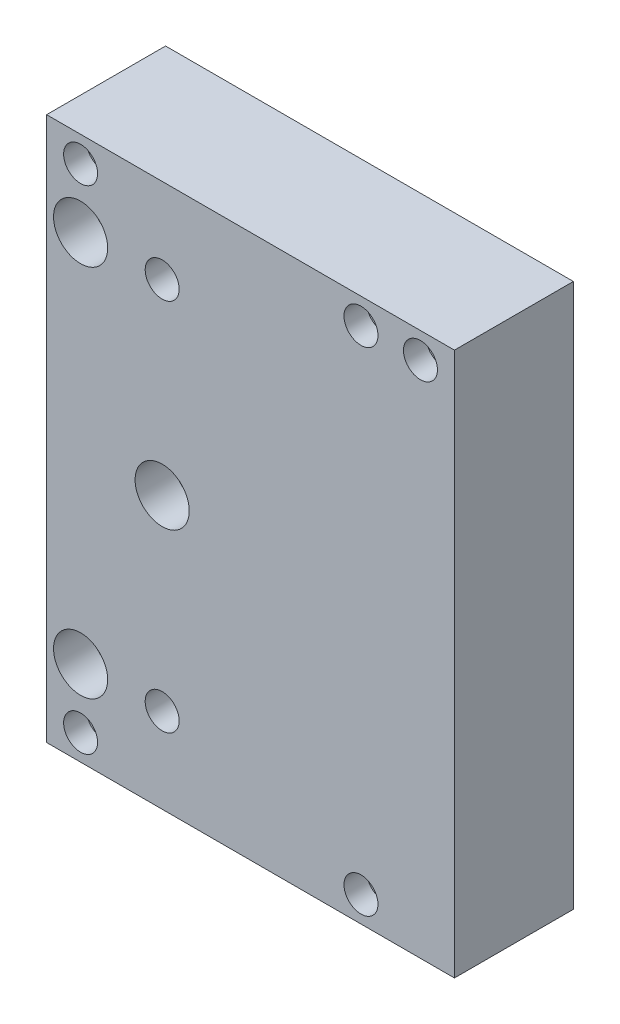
ISO-10303-21;
HEADER;
FILE_DESCRIPTION(('STEP AP214'),'2;1');
FILE_NAME('part.step','',(''),(''),'','','');
FILE_SCHEMA(('AUTOMOTIVE_DESIGN { 1 0 10303 214 1 1 1 1 }'));
ENDSEC;
DATA;
#1=APPLICATION_CONTEXT('core data for automotive mechanical design processes');
#2=APPLICATION_PROTOCOL_DEFINITION('international standard','automotive_design',2000,#1);
#3=PRODUCT_CONTEXT('',#1,'mechanical');
#4=PRODUCT('Part','Part','',(#3));
#5=PRODUCT_RELATED_PRODUCT_CATEGORY('part','',(#4));
#6=PRODUCT_DEFINITION_FORMATION('','',#4);
#7=PRODUCT_DEFINITION_CONTEXT('part definition',#1,'design');
#8=PRODUCT_DEFINITION('design','',#6,#7);
#9=PRODUCT_DEFINITION_SHAPE('','',#8);
#10=(LENGTH_UNIT() NAMED_UNIT(*) SI_UNIT(.MILLI.,.METRE.));
#11=(NAMED_UNIT(*) PLANE_ANGLE_UNIT() SI_UNIT($,.RADIAN.));
#12=(NAMED_UNIT(*) SI_UNIT($,.STERADIAN.) SOLID_ANGLE_UNIT());
#13=UNCERTAINTY_MEASURE_WITH_UNIT(LENGTH_MEASURE(1.E-05),#10,'distance_accuracy_value','');
#14=(GEOMETRIC_REPRESENTATION_CONTEXT(3) GLOBAL_UNCERTAINTY_ASSIGNED_CONTEXT((#13)) GLOBAL_UNIT_ASSIGNED_CONTEXT((#10,
#11,#12)) REPRESENTATION_CONTEXT('',''));
#15=CARTESIAN_POINT('',(0.,0.,0.));
#16=DIRECTION('',(0.,0.,1.));
#17=DIRECTION('',(1.,0.,0.));
#18=AXIS2_PLACEMENT_3D('',#15,#16,#17);
#19=CARTESIAN_POINT('',(-55.88,101.6,44.45));
#20=DIRECTION('',(1.,0.,0.));
#21=DIRECTION('',(0.,1.,0.));
#22=AXIS2_PLACEMENT_3D('',#19,#20,#21);
#23=PLANE('',#22);
#24=DIRECTION('',(0.,-1.,0.));
#25=VECTOR('',#24,1.);
#26=CARTESIAN_POINT('',(-55.88,101.6,0.));
#27=LINE('',#26,#25);
#28=CARTESIAN_POINT('',(-55.88,101.6,0.));
#29=VERTEX_POINT('',#28);
#30=CARTESIAN_POINT('',(-55.88,-101.6,0.));
#31=VERTEX_POINT('',#30);
#32=EDGE_CURVE('E123',#29,#31,#27,.T.);
#33=ORIENTED_EDGE('',*,*,#32,.T.);
#34=DIRECTION('',(0.,0.,-1.));
#35=VECTOR('',#34,1.);
#36=CARTESIAN_POINT('',(-55.88,-101.6,44.45));
#37=LINE('',#36,#35);
#38=CARTESIAN_POINT('',(-55.88,-101.6,44.45));
#39=VERTEX_POINT('',#38);
#40=EDGE_CURVE('E12',#39,#31,#37,.T.);
#41=ORIENTED_EDGE('',*,*,#40,.F.);
#42=DIRECTION('',(0.,-1.,0.));
#43=VECTOR('',#42,1.);
#44=CARTESIAN_POINT('',(-55.88,101.6,44.45));
#45=LINE('',#44,#43);
#46=CARTESIAN_POINT('',(-55.88,101.6,44.45));
#47=VERTEX_POINT('',#46);
#48=EDGE_CURVE('E106',#47,#39,#45,.T.);
#49=ORIENTED_EDGE('',*,*,#48,.F.);
#50=DIRECTION('',(0.,0.,-1.));
#51=VECTOR('',#50,1.);
#52=CARTESIAN_POINT('',(-55.88,101.6,44.45));
#53=LINE('',#52,#51);
#54=EDGE_CURVE('E119',#47,#29,#53,.T.);
#55=ORIENTED_EDGE('',*,*,#54,.T.);
#56=EDGE_LOOP('',(#33,#41,#49,#55));
#57=FACE_BOUND('',#56,.T.);
#58=ADVANCED_FACE('F54',(#57),#23,.F.);
#59=CARTESIAN_POINT('',(-55.88,-101.6,44.45));
#60=DIRECTION('',(0.,1.,0.));
#61=DIRECTION('',(-1.,0.,0.));
#62=AXIS2_PLACEMENT_3D('',#59,#60,#61);
#63=PLANE('',#62);
#64=DIRECTION('',(1.,0.,0.));
#65=VECTOR('',#64,1.);
#66=CARTESIAN_POINT('',(-55.88,-101.6,0.));
#67=LINE('',#66,#65);
#68=CARTESIAN_POINT('',(96.52,-101.6,0.));
#69=VERTEX_POINT('',#68);
#70=EDGE_CURVE('E111',#31,#69,#67,.T.);
#71=ORIENTED_EDGE('',*,*,#70,.T.);
#72=DIRECTION('',(0.,0.,-1.));
#73=VECTOR('',#72,1.);
#74=CARTESIAN_POINT('',(96.52,-101.6,44.45));
#75=LINE('',#74,#73);
#76=CARTESIAN_POINT('',(96.52,-101.6,44.45));
#77=VERTEX_POINT('',#76);
#78=EDGE_CURVE('E63',#77,#69,#75,.T.);
#79=ORIENTED_EDGE('',*,*,#78,.F.);
#80=DIRECTION('',(1.,0.,0.));
#81=VECTOR('',#80,1.);
#82=CARTESIAN_POINT('',(-55.88,-101.6,44.45));
#83=LINE('',#82,#81);
#84=EDGE_CURVE('E101',#39,#77,#83,.T.);
#85=ORIENTED_EDGE('',*,*,#84,.F.);
#86=ORIENTED_EDGE('',*,*,#40,.T.);
#87=EDGE_LOOP('',(#71,#79,#85,#86));
#88=FACE_BOUND('',#87,.T.);
#89=ADVANCED_FACE('F110',(#88),#63,.F.);
#90=CARTESIAN_POINT('',(96.52,101.6,44.45));
#91=DIRECTION('',(-1.,0.,0.));
#92=DIRECTION('',(0.,-1.,0.));
#93=AXIS2_PLACEMENT_3D('',#90,#91,#92);
#94=PLANE('',#93);
#95=DIRECTION('',(0.,1.,0.));
#96=VECTOR('',#95,1.);
#97=CARTESIAN_POINT('',(96.52,101.6,0.));
#98=LINE('',#97,#96);
#99=CARTESIAN_POINT('',(96.52,101.6,0.));
#100=VERTEX_POINT('',#99);
#101=EDGE_CURVE('E88',#69,#100,#98,.T.);
#102=ORIENTED_EDGE('',*,*,#101,.T.);
#103=DIRECTION('',(0.,0.,-1.));
#104=VECTOR('',#103,1.);
#105=CARTESIAN_POINT('',(96.52,101.6,44.45));
#106=LINE('',#105,#104);
#107=CARTESIAN_POINT('',(96.52,101.6,44.45));
#108=VERTEX_POINT('',#107);
#109=EDGE_CURVE('E113',#108,#100,#106,.T.);
#110=ORIENTED_EDGE('',*,*,#109,.F.);
#111=DIRECTION('',(0.,1.,0.));
#112=VECTOR('',#111,1.);
#113=CARTESIAN_POINT('',(96.52,101.6,44.45));
#114=LINE('',#113,#112);
#115=EDGE_CURVE('E104',#77,#108,#114,.T.);
#116=ORIENTED_EDGE('',*,*,#115,.F.);
#117=ORIENTED_EDGE('',*,*,#78,.T.);
#118=EDGE_LOOP('',(#102,#110,#116,#117));
#119=FACE_BOUND('',#118,.T.);
#120=ADVANCED_FACE('F114',(#119),#94,.F.);
#121=CARTESIAN_POINT('',(-55.88,101.6,44.45));
#122=DIRECTION('',(0.,-1.,0.));
#123=DIRECTION('',(1.,0.,0.));
#124=AXIS2_PLACEMENT_3D('',#121,#122,#123);
#125=PLANE('',#124);
#126=DIRECTION('',(-1.,0.,0.));
#127=VECTOR('',#126,1.);
#128=CARTESIAN_POINT('',(-55.88,101.6,0.));
#129=LINE('',#128,#127);
#130=EDGE_CURVE('E94',#100,#29,#129,.T.);
#131=ORIENTED_EDGE('',*,*,#130,.T.);
#132=ORIENTED_EDGE('',*,*,#54,.F.);
#133=DIRECTION('',(-1.,0.,0.));
#134=VECTOR('',#133,1.);
#135=CARTESIAN_POINT('',(-55.88,101.6,44.45));
#136=LINE('',#135,#134);
#137=EDGE_CURVE('E71',#108,#47,#136,.T.);
#138=ORIENTED_EDGE('',*,*,#137,.F.);
#139=ORIENTED_EDGE('',*,*,#109,.T.);
#140=EDGE_LOOP('',(#131,#132,#138,#139));
#141=FACE_BOUND('',#140,.T.);
#142=ADVANCED_FACE('F138',(#141),#125,.F.);
#143=CARTESIAN_POINT('',(0.,0.,44.45));
#144=DIRECTION('',(0.,0.,1.));
#145=DIRECTION('',(1.,0.,0.));
#146=AXIS2_PLACEMENT_3D('',#143,#144,#145);
#147=PLANE('',#146);
#148=CARTESIAN_POINT('',(-43.18,-69.85,44.45));
#149=DIRECTION('',(0.,0.,1.));
#150=DIRECTION('',(1.,0.,0.));
#151=AXIS2_PLACEMENT_3D('',#148,#149,#150);
#152=CIRCLE('',#151,10.1219);
#153=CARTESIAN_POINT('',(-33.0581,-69.85,44.45));
#154=VERTEX_POINT('',#153);
#155=EDGE_CURVE('E629',#154,#154,#152,.T.);
#156=ORIENTED_EDGE('',*,*,#155,.F.);
#157=EDGE_LOOP('',(#156));
#158=FACE_BOUND('',#157,.T.);
#159=CARTESIAN_POINT('',(-12.7,0.,44.45));
#160=DIRECTION('',(0.,0.,1.));
#161=DIRECTION('',(1.,0.,0.));
#162=AXIS2_PLACEMENT_3D('',#159,#160,#161);
#163=CIRCLE('',#162,10.1219);
#164=CARTESIAN_POINT('',(-2.5781,0.,44.45));
#165=VERTEX_POINT('',#164);
#166=EDGE_CURVE('E188',#165,#165,#163,.T.);
#167=ORIENTED_EDGE('',*,*,#166,.F.);
#168=EDGE_LOOP('',(#167));
#169=FACE_BOUND('',#168,.T.);
#170=CARTESIAN_POINT('',(-43.18,69.85,44.45));
#171=DIRECTION('',(0.,0.,1.));
#172=DIRECTION('',(1.,0.,0.));
#173=AXIS2_PLACEMENT_3D('',#170,#171,#172);
#174=CIRCLE('',#173,10.1219);
#175=CARTESIAN_POINT('',(-33.0581,69.85,44.45));
#176=VERTEX_POINT('',#175);
#177=EDGE_CURVE('E162',#176,#176,#174,.T.);
#178=ORIENTED_EDGE('',*,*,#177,.F.);
#179=EDGE_LOOP('',(#178));
#180=FACE_BOUND('',#179,.T.);
#181=CARTESIAN_POINT('',(-12.7,69.8499999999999,44.45));
#182=DIRECTION('',(0.,0.,-1.));
#183=DIRECTION('',(-1.,0.,0.));
#184=AXIS2_PLACEMENT_3D('',#181,#182,#183);
#185=CIRCLE('',#184,6.34999999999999);
#186=CARTESIAN_POINT('',(-19.05,69.8499999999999,44.45));
#187=VERTEX_POINT('',#186);
#188=EDGE_CURVE('E168',#187,#187,#185,.T.);
#189=ORIENTED_EDGE('',*,*,#188,.T.);
#190=EDGE_LOOP('',(#189));
#191=FACE_BOUND('',#190,.T.);
#192=CARTESIAN_POINT('',(-12.7,-69.8500000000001,44.45));
#193=DIRECTION('',(0.,0.,-1.));
#194=DIRECTION('',(-1.,0.,0.));
#195=AXIS2_PLACEMENT_3D('',#192,#193,#194);
#196=CIRCLE('',#195,6.34999999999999);
#197=CARTESIAN_POINT('',(-19.05,-69.8500000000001,44.45));
#198=VERTEX_POINT('',#197);
#199=EDGE_CURVE('E221',#198,#198,#196,.T.);
#200=ORIENTED_EDGE('',*,*,#199,.T.);
#201=EDGE_LOOP('',(#200));
#202=FACE_BOUND('',#201,.T.);
#203=CARTESIAN_POINT('',(83.82,92.0242,44.45));
#204=DIRECTION('',(0.,0.,1.));
#205=DIRECTION('',(1.,0.,0.));
#206=AXIS2_PLACEMENT_3D('',#203,#204,#205);
#207=CIRCLE('',#206,6.34999999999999);
#208=CARTESIAN_POINT('',(90.17,92.0242,44.45));
#209=VERTEX_POINT('',#208);
#210=EDGE_CURVE('E225',#209,#209,#207,.T.);
#211=ORIENTED_EDGE('',*,*,#210,.F.);
#212=EDGE_LOOP('',(#211));
#213=FACE_BOUND('',#212,.T.);
#214=CARTESIAN_POINT('',(-43.18,92.0242,44.45));
#215=DIRECTION('',(0.,0.,1.));
#216=DIRECTION('',(1.,0.,0.));
#217=AXIS2_PLACEMENT_3D('',#214,#215,#216);
#218=CIRCLE('',#217,6.35);
#219=CARTESIAN_POINT('',(-36.83,92.0242,44.45));
#220=VERTEX_POINT('',#219);
#221=EDGE_CURVE('E229',#220,#220,#218,.T.);
#222=ORIENTED_EDGE('',*,*,#221,.F.);
#223=EDGE_LOOP('',(#222));
#224=FACE_BOUND('',#223,.T.);
#225=CARTESIAN_POINT('',(61.595,92.0242,44.45));
#226=DIRECTION('',(0.,0.,1.));
#227=DIRECTION('',(1.,0.,0.));
#228=AXIS2_PLACEMENT_3D('',#225,#226,#227);
#229=CIRCLE('',#228,6.34999999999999);
#230=CARTESIAN_POINT('',(67.945,92.0242,44.45));
#231=VERTEX_POINT('',#230);
#232=EDGE_CURVE('E233',#231,#231,#229,.T.);
#233=ORIENTED_EDGE('',*,*,#232,.F.);
#234=EDGE_LOOP('',(#233));
#235=FACE_BOUND('',#234,.T.);
#236=CARTESIAN_POINT('',(61.595,-92.0242,44.45));
#237=DIRECTION('',(0.,0.,1.));
#238=DIRECTION('',(1.,0.,0.));
#239=AXIS2_PLACEMENT_3D('',#236,#237,#238);
#240=CIRCLE('',#239,6.34999999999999);
#241=CARTESIAN_POINT('',(67.945,-92.0242,44.45));
#242=VERTEX_POINT('',#241);
#243=EDGE_CURVE('E237',#242,#242,#240,.T.);
#244=ORIENTED_EDGE('',*,*,#243,.F.);
#245=EDGE_LOOP('',(#244));
#246=FACE_BOUND('',#245,.T.);
#247=CARTESIAN_POINT('',(-43.18,-92.0242,44.45));
#248=DIRECTION('',(0.,0.,1.));
#249=DIRECTION('',(1.,0.,0.));
#250=AXIS2_PLACEMENT_3D('',#247,#248,#249);
#251=CIRCLE('',#250,6.35);
#252=CARTESIAN_POINT('',(-36.83,-92.0242,44.45));
#253=VERTEX_POINT('',#252);
#254=EDGE_CURVE('E127',#253,#253,#251,.T.);
#255=ORIENTED_EDGE('',*,*,#254,.F.);
#256=EDGE_LOOP('',(#255));
#257=FACE_BOUND('',#256,.T.);
#258=ORIENTED_EDGE('',*,*,#48,.T.);
#259=ORIENTED_EDGE('',*,*,#84,.T.);
#260=ORIENTED_EDGE('',*,*,#115,.T.);
#261=ORIENTED_EDGE('',*,*,#137,.T.);
#262=EDGE_LOOP('',(#258,#259,#260,#261));
#263=FACE_BOUND('',#262,.T.);
#264=ADVANCED_FACE('F102',(#158,#169,#180,#191,#202,#213,#224,#235,#246,#257,#263),#147,.T.);
#265=CARTESIAN_POINT('',(0.,0.,0.));
#266=DIRECTION('',(0.,0.,1.));
#267=DIRECTION('',(1.,0.,0.));
#268=AXIS2_PLACEMENT_3D('',#265,#266,#267);
#269=PLANE('',#268);
#270=CARTESIAN_POINT('',(-43.18,-69.85,0.));
#271=DIRECTION('',(0.,0.,1.));
#272=DIRECTION('',(1.,0.,0.));
#273=AXIS2_PLACEMENT_3D('',#270,#271,#272);
#274=CIRCLE('',#273,6.74369999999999);
#275=CARTESIAN_POINT('',(-36.4363,-69.85,0.));
#276=VERTEX_POINT('',#275);
#277=EDGE_CURVE('E619',#276,#276,#274,.T.);
#278=ORIENTED_EDGE('',*,*,#277,.T.);
#279=EDGE_LOOP('',(#278));
#280=FACE_BOUND('',#279,.T.);
#281=CARTESIAN_POINT('',(-12.7,0.,0.));
#282=DIRECTION('',(0.,0.,1.));
#283=DIRECTION('',(1.,0.,0.));
#284=AXIS2_PLACEMENT_3D('',#281,#282,#283);
#285=CIRCLE('',#284,6.74369999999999);
#286=CARTESIAN_POINT('',(-5.95630000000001,0.,0.));
#287=VERTEX_POINT('',#286);
#288=EDGE_CURVE('E649',#287,#287,#285,.T.);
#289=ORIENTED_EDGE('',*,*,#288,.T.);
#290=EDGE_LOOP('',(#289));
#291=FACE_BOUND('',#290,.T.);
#292=CARTESIAN_POINT('',(-43.18,69.85,0.));
#293=DIRECTION('',(0.,0.,1.));
#294=DIRECTION('',(1.,0.,0.));
#295=AXIS2_PLACEMENT_3D('',#292,#293,#294);
#296=CIRCLE('',#295,6.74369999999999);
#297=CARTESIAN_POINT('',(-36.4363,69.85,0.));
#298=VERTEX_POINT('',#297);
#299=EDGE_CURVE('E182',#298,#298,#296,.T.);
#300=ORIENTED_EDGE('',*,*,#299,.T.);
#301=EDGE_LOOP('',(#300));
#302=FACE_BOUND('',#301,.T.);
#303=CARTESIAN_POINT('',(-12.7,69.8499999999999,0.));
#304=DIRECTION('',(0.,0.,-1.));
#305=DIRECTION('',(-1.,0.,0.));
#306=AXIS2_PLACEMENT_3D('',#303,#304,#305);
#307=CIRCLE('',#306,6.34999999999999);
#308=CARTESIAN_POINT('',(-19.05,69.8499999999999,0.));
#309=VERTEX_POINT('',#308);
#310=EDGE_CURVE('E684',#309,#309,#307,.T.);
#311=ORIENTED_EDGE('',*,*,#310,.F.);
#312=EDGE_LOOP('',(#311));
#313=FACE_BOUND('',#312,.T.);
#314=CARTESIAN_POINT('',(-12.7,-69.8500000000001,0.));
#315=DIRECTION('',(0.,0.,-1.));
#316=DIRECTION('',(-1.,0.,0.));
#317=AXIS2_PLACEMENT_3D('',#314,#315,#316);
#318=CIRCLE('',#317,6.34999999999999);
#319=CARTESIAN_POINT('',(-19.05,-69.8500000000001,0.));
#320=VERTEX_POINT('',#319);
#321=EDGE_CURVE('E688',#320,#320,#318,.T.);
#322=ORIENTED_EDGE('',*,*,#321,.F.);
#323=EDGE_LOOP('',(#322));
#324=FACE_BOUND('',#323,.T.);
#325=CARTESIAN_POINT('',(83.82,92.0242,0.));
#326=DIRECTION('',(0.,0.,1.));
#327=DIRECTION('',(1.,0.,0.));
#328=AXIS2_PLACEMENT_3D('',#325,#326,#327);
#329=CIRCLE('',#328,3.96874999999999);
#330=CARTESIAN_POINT('',(87.78875,92.0242,0.));
#331=VERTEX_POINT('',#330);
#332=EDGE_CURVE('E692',#331,#331,#329,.T.);
#333=ORIENTED_EDGE('',*,*,#332,.T.);
#334=EDGE_LOOP('',(#333));
#335=FACE_BOUND('',#334,.T.);
#336=CARTESIAN_POINT('',(-43.18,92.0242,0.));
#337=DIRECTION('',(0.,0.,1.));
#338=DIRECTION('',(1.,0.,0.));
#339=AXIS2_PLACEMENT_3D('',#336,#337,#338);
#340=CIRCLE('',#339,3.96875);
#341=CARTESIAN_POINT('',(-39.21125,92.0242,0.));
#342=VERTEX_POINT('',#341);
#343=EDGE_CURVE('E696',#342,#342,#340,.T.);
#344=ORIENTED_EDGE('',*,*,#343,.T.);
#345=EDGE_LOOP('',(#344));
#346=FACE_BOUND('',#345,.T.);
#347=CARTESIAN_POINT('',(61.595,92.0242,0.));
#348=DIRECTION('',(0.,0.,1.));
#349=DIRECTION('',(1.,0.,0.));
#350=AXIS2_PLACEMENT_3D('',#347,#348,#349);
#351=CIRCLE('',#350,3.96874999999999);
#352=CARTESIAN_POINT('',(65.56375,92.0242,0.));
#353=VERTEX_POINT('',#352);
#354=EDGE_CURVE('E700',#353,#353,#351,.T.);
#355=ORIENTED_EDGE('',*,*,#354,.T.);
#356=EDGE_LOOP('',(#355));
#357=FACE_BOUND('',#356,.T.);
#358=CARTESIAN_POINT('',(61.595,-92.0242,0.));
#359=DIRECTION('',(0.,0.,1.));
#360=DIRECTION('',(1.,0.,0.));
#361=AXIS2_PLACEMENT_3D('',#358,#359,#360);
#362=CIRCLE('',#361,3.96874999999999);
#363=CARTESIAN_POINT('',(65.56375,-92.0242,0.));
#364=VERTEX_POINT('',#363);
#365=EDGE_CURVE('E704',#364,#364,#362,.T.);
#366=ORIENTED_EDGE('',*,*,#365,.T.);
#367=EDGE_LOOP('',(#366));
#368=FACE_BOUND('',#367,.T.);
#369=CARTESIAN_POINT('',(-43.18,-92.0242,0.));
#370=DIRECTION('',(0.,0.,1.));
#371=DIRECTION('',(1.,0.,0.));
#372=AXIS2_PLACEMENT_3D('',#369,#370,#371);
#373=CIRCLE('',#372,3.96875);
#374=CARTESIAN_POINT('',(-39.21125,-92.0242,0.));
#375=VERTEX_POINT('',#374);
#376=EDGE_CURVE('E707',#375,#375,#373,.T.);
#377=ORIENTED_EDGE('',*,*,#376,.T.);
#378=EDGE_LOOP('',(#377));
#379=FACE_BOUND('',#378,.T.);
#380=ORIENTED_EDGE('',*,*,#32,.F.);
#381=ORIENTED_EDGE('',*,*,#130,.F.);
#382=ORIENTED_EDGE('',*,*,#101,.F.);
#383=ORIENTED_EDGE('',*,*,#70,.F.);
#384=EDGE_LOOP('',(#380,#381,#382,#383));
#385=FACE_BOUND('',#384,.T.);
#386=ADVANCED_FACE('F141',(#280,#291,#302,#313,#324,#335,#346,#357,#368,#379,#385),#269,.F.);
#387=CARTESIAN_POINT('',(-43.18,-92.0242,44.45));
#388=DIRECTION('',(0.,0.,1.));
#389=DIRECTION('',(1.,0.,0.));
#390=AXIS2_PLACEMENT_3D('',#387,#388,#389);
#391=CYLINDRICAL_SURFACE('',#390,6.35);
#392=CARTESIAN_POINT('',(-43.18,-92.0242,35.9664));
#393=DIRECTION('',(0.,0.,1.));
#394=DIRECTION('',(1.,0.,0.));
#395=AXIS2_PLACEMENT_3D('',#392,#393,#394);
#396=CIRCLE('',#395,6.35);
#397=CARTESIAN_POINT('',(-36.83,-92.0242,35.9664));
#398=VERTEX_POINT('',#397);
#399=EDGE_CURVE('E150',#398,#398,#396,.T.);
#400=ORIENTED_EDGE('',*,*,#399,.F.);
#401=EDGE_LOOP('',(#400));
#402=FACE_BOUND('',#401,.T.);
#403=ORIENTED_EDGE('',*,*,#254,.T.);
#404=EDGE_LOOP('',(#403));
#405=FACE_BOUND('',#404,.T.);
#406=ADVANCED_FACE('F240',(#402,#405),#391,.F.);
#407=CARTESIAN_POINT('',(-36.83,-92.0242,35.9664));
#408=DIRECTION('',(0.,0.,-1.));
#409=DIRECTION('',(-1.,0.,0.));
#410=AXIS2_PLACEMENT_3D('',#407,#408,#409);
#411=PLANE('',#410);
#412=CARTESIAN_POINT('',(-43.18,-92.0242,35.9664));
#413=DIRECTION('',(0.,0.,1.));
#414=DIRECTION('',(1.,0.,0.));
#415=AXIS2_PLACEMENT_3D('',#412,#413,#414);
#416=CIRCLE('',#415,3.96875);
#417=CARTESIAN_POINT('',(-39.21125,-92.0242,35.9664));
#418=VERTEX_POINT('',#417);
#419=EDGE_CURVE('E709',#418,#418,#416,.T.);
#420=ORIENTED_EDGE('',*,*,#419,.F.);
#421=EDGE_LOOP('',(#420));
#422=FACE_BOUND('',#421,.T.);
#423=ORIENTED_EDGE('',*,*,#399,.T.);
#424=EDGE_LOOP('',(#423));
#425=FACE_BOUND('',#424,.T.);
#426=ADVANCED_FACE('F242',(#422,#425),#411,.F.);
#427=CARTESIAN_POINT('',(-43.18,-92.0242,44.45));
#428=DIRECTION('',(0.,0.,1.));
#429=DIRECTION('',(1.,0.,0.));
#430=AXIS2_PLACEMENT_3D('',#427,#428,#429);
#431=CYLINDRICAL_SURFACE('',#430,3.96875);
#432=ORIENTED_EDGE('',*,*,#376,.F.);
#433=EDGE_LOOP('',(#432));
#434=FACE_BOUND('',#433,.T.);
#435=ORIENTED_EDGE('',*,*,#419,.T.);
#436=EDGE_LOOP('',(#435));
#437=FACE_BOUND('',#436,.T.);
#438=ADVANCED_FACE('F249',(#434,#437),#431,.F.);
#439=CARTESIAN_POINT('',(61.595,-92.0242,44.45));
#440=DIRECTION('',(0.,0.,1.));
#441=DIRECTION('',(1.,0.,0.));
#442=AXIS2_PLACEMENT_3D('',#439,#440,#441);
#443=CYLINDRICAL_SURFACE('',#442,6.34999999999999);
#444=CARTESIAN_POINT('',(61.595,-92.0242,35.9664));
#445=DIRECTION('',(0.,0.,1.));
#446=DIRECTION('',(1.,0.,0.));
#447=AXIS2_PLACEMENT_3D('',#444,#445,#446);
#448=CIRCLE('',#447,6.34999999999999);
#449=CARTESIAN_POINT('',(67.945,-92.0242,35.9664));
#450=VERTEX_POINT('',#449);
#451=EDGE_CURVE('E715',#450,#450,#448,.T.);
#452=ORIENTED_EDGE('',*,*,#451,.F.);
#453=EDGE_LOOP('',(#452));
#454=FACE_BOUND('',#453,.T.);
#455=ORIENTED_EDGE('',*,*,#243,.T.);
#456=EDGE_LOOP('',(#455));
#457=FACE_BOUND('',#456,.T.);
#458=ADVANCED_FACE('F305',(#454,#457),#443,.F.);
#459=CARTESIAN_POINT('',(67.945,-92.0242,35.9664));
#460=DIRECTION('',(0.,0.,-1.));
#461=DIRECTION('',(-1.,0.,0.));
#462=AXIS2_PLACEMENT_3D('',#459,#460,#461);
#463=PLANE('',#462);
#464=CARTESIAN_POINT('',(61.595,-92.0242,35.9664));
#465=DIRECTION('',(0.,0.,1.));
#466=DIRECTION('',(1.,0.,0.));
#467=AXIS2_PLACEMENT_3D('',#464,#465,#466);
#468=CIRCLE('',#467,3.96875000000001);
#469=CARTESIAN_POINT('',(65.56375,-92.0242,35.9664));
#470=VERTEX_POINT('',#469);
#471=EDGE_CURVE('E729',#470,#470,#468,.T.);
#472=ORIENTED_EDGE('',*,*,#471,.F.);
#473=EDGE_LOOP('',(#472));
#474=FACE_BOUND('',#473,.T.);
#475=ORIENTED_EDGE('',*,*,#451,.T.);
#476=EDGE_LOOP('',(#475));
#477=FACE_BOUND('',#476,.T.);
#478=ADVANCED_FACE('F318',(#474,#477),#463,.F.);
#479=CARTESIAN_POINT('',(61.595,-92.0242,44.45));
#480=DIRECTION('',(0.,0.,1.));
#481=DIRECTION('',(1.,0.,0.));
#482=AXIS2_PLACEMENT_3D('',#479,#480,#481);
#483=CYLINDRICAL_SURFACE('',#482,3.96875);
#484=ORIENTED_EDGE('',*,*,#365,.F.);
#485=EDGE_LOOP('',(#484));
#486=FACE_BOUND('',#485,.T.);
#487=ORIENTED_EDGE('',*,*,#471,.T.);
#488=EDGE_LOOP('',(#487));
#489=FACE_BOUND('',#488,.T.);
#490=ADVANCED_FACE('F329',(#486,#489),#483,.F.);
#491=CARTESIAN_POINT('',(61.595,92.0242,44.45));
#492=DIRECTION('',(0.,0.,1.));
#493=DIRECTION('',(1.,0.,0.));
#494=AXIS2_PLACEMENT_3D('',#491,#492,#493);
#495=CYLINDRICAL_SURFACE('',#494,6.34999999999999);
#496=CARTESIAN_POINT('',(61.595,92.0242,35.9664));
#497=DIRECTION('',(0.,0.,1.));
#498=DIRECTION('',(1.,0.,0.));
#499=AXIS2_PLACEMENT_3D('',#496,#497,#498);
#500=CIRCLE('',#499,6.34999999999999);
#501=CARTESIAN_POINT('',(67.945,92.0242,35.9664));
#502=VERTEX_POINT('',#501);
#503=EDGE_CURVE('E741',#502,#502,#500,.T.);
#504=ORIENTED_EDGE('',*,*,#503,.F.);
#505=EDGE_LOOP('',(#504));
#506=FACE_BOUND('',#505,.T.);
#507=ORIENTED_EDGE('',*,*,#232,.T.);
#508=EDGE_LOOP('',(#507));
#509=FACE_BOUND('',#508,.T.);
#510=ADVANCED_FACE('F339',(#506,#509),#495,.F.);
#511=CARTESIAN_POINT('',(67.945,92.0242,35.9664));
#512=DIRECTION('',(0.,0.,-1.));
#513=DIRECTION('',(-1.,0.,0.));
#514=AXIS2_PLACEMENT_3D('',#511,#512,#513);
#515=PLANE('',#514);
#516=CARTESIAN_POINT('',(61.595,92.0242,35.9664));
#517=DIRECTION('',(0.,0.,1.));
#518=DIRECTION('',(1.,0.,0.));
#519=AXIS2_PLACEMENT_3D('',#516,#517,#518);
#520=CIRCLE('',#519,3.96875000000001);
#521=CARTESIAN_POINT('',(65.56375,92.0242,35.9664));
#522=VERTEX_POINT('',#521);
#523=EDGE_CURVE('E746',#522,#522,#520,.T.);
#524=ORIENTED_EDGE('',*,*,#523,.F.);
#525=EDGE_LOOP('',(#524));
#526=FACE_BOUND('',#525,.T.);
#527=ORIENTED_EDGE('',*,*,#503,.T.);
#528=EDGE_LOOP('',(#527));
#529=FACE_BOUND('',#528,.T.);
#530=ADVANCED_FACE('F352',(#526,#529),#515,.F.);
#531=CARTESIAN_POINT('',(61.595,92.0242,44.45));
#532=DIRECTION('',(0.,0.,1.));
#533=DIRECTION('',(1.,0.,0.));
#534=AXIS2_PLACEMENT_3D('',#531,#532,#533);
#535=CYLINDRICAL_SURFACE('',#534,3.96875);
#536=ORIENTED_EDGE('',*,*,#354,.F.);
#537=EDGE_LOOP('',(#536));
#538=FACE_BOUND('',#537,.T.);
#539=ORIENTED_EDGE('',*,*,#523,.T.);
#540=EDGE_LOOP('',(#539));
#541=FACE_BOUND('',#540,.T.);
#542=ADVANCED_FACE('F363',(#538,#541),#535,.F.);
#543=CARTESIAN_POINT('',(-43.18,92.0242,44.45));
#544=DIRECTION('',(0.,0.,1.));
#545=DIRECTION('',(1.,0.,0.));
#546=AXIS2_PLACEMENT_3D('',#543,#544,#545);
#547=CYLINDRICAL_SURFACE('',#546,6.35);
#548=CARTESIAN_POINT('',(-43.18,92.0242,35.9664));
#549=DIRECTION('',(0.,0.,1.));
#550=DIRECTION('',(1.,0.,0.));
#551=AXIS2_PLACEMENT_3D('',#548,#549,#550);
#552=CIRCLE('',#551,6.35);
#553=CARTESIAN_POINT('',(-36.83,92.0242,35.9664));
#554=VERTEX_POINT('',#553);
#555=EDGE_CURVE('E767',#554,#554,#552,.T.);
#556=ORIENTED_EDGE('',*,*,#555,.F.);
#557=EDGE_LOOP('',(#556));
#558=FACE_BOUND('',#557,.T.);
#559=ORIENTED_EDGE('',*,*,#221,.T.);
#560=EDGE_LOOP('',(#559));
#561=FACE_BOUND('',#560,.T.);
#562=ADVANCED_FACE('F373',(#558,#561),#547,.F.);
#563=CARTESIAN_POINT('',(-36.83,92.0242,35.9664));
#564=DIRECTION('',(0.,0.,-1.));
#565=DIRECTION('',(-1.,0.,0.));
#566=AXIS2_PLACEMENT_3D('',#563,#564,#565);
#567=PLANE('',#566);
#568=CARTESIAN_POINT('',(-43.18,92.0242,35.9664));
#569=DIRECTION('',(0.,0.,1.));
#570=DIRECTION('',(1.,0.,0.));
#571=AXIS2_PLACEMENT_3D('',#568,#569,#570);
#572=CIRCLE('',#571,3.96875);
#573=CARTESIAN_POINT('',(-39.21125,92.0242,35.9664));
#574=VERTEX_POINT('',#573);
#575=EDGE_CURVE('E772',#574,#574,#572,.T.);
#576=ORIENTED_EDGE('',*,*,#575,.F.);
#577=EDGE_LOOP('',(#576));
#578=FACE_BOUND('',#577,.T.);
#579=ORIENTED_EDGE('',*,*,#555,.T.);
#580=EDGE_LOOP('',(#579));
#581=FACE_BOUND('',#580,.T.);
#582=ADVANCED_FACE('F386',(#578,#581),#567,.F.);
#583=CARTESIAN_POINT('',(-43.18,92.0242,44.45));
#584=DIRECTION('',(0.,0.,1.));
#585=DIRECTION('',(1.,0.,0.));
#586=AXIS2_PLACEMENT_3D('',#583,#584,#585);
#587=CYLINDRICAL_SURFACE('',#586,3.96875);
#588=ORIENTED_EDGE('',*,*,#343,.F.);
#589=EDGE_LOOP('',(#588));
#590=FACE_BOUND('',#589,.T.);
#591=ORIENTED_EDGE('',*,*,#575,.T.);
#592=EDGE_LOOP('',(#591));
#593=FACE_BOUND('',#592,.T.);
#594=ADVANCED_FACE('F397',(#590,#593),#587,.F.);
#595=CARTESIAN_POINT('',(83.82,92.0242,44.45));
#596=DIRECTION('',(0.,0.,1.));
#597=DIRECTION('',(1.,0.,0.));
#598=AXIS2_PLACEMENT_3D('',#595,#596,#597);
#599=CYLINDRICAL_SURFACE('',#598,6.34999999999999);
#600=CARTESIAN_POINT('',(83.82,92.0242,35.9664));
#601=DIRECTION('',(0.,0.,1.));
#602=DIRECTION('',(1.,0.,0.));
#603=AXIS2_PLACEMENT_3D('',#600,#601,#602);
#604=CIRCLE('',#603,6.34999999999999);
#605=CARTESIAN_POINT('',(90.17,92.0242,35.9664));
#606=VERTEX_POINT('',#605);
#607=EDGE_CURVE('E783',#606,#606,#604,.T.);
#608=ORIENTED_EDGE('',*,*,#607,.F.);
#609=EDGE_LOOP('',(#608));
#610=FACE_BOUND('',#609,.T.);
#611=ORIENTED_EDGE('',*,*,#210,.T.);
#612=EDGE_LOOP('',(#611));
#613=FACE_BOUND('',#612,.T.);
#614=ADVANCED_FACE('F407',(#610,#613),#599,.F.);
#615=CARTESIAN_POINT('',(90.17,92.0242,35.9664));
#616=DIRECTION('',(0.,0.,-1.));
#617=DIRECTION('',(-1.,0.,0.));
#618=AXIS2_PLACEMENT_3D('',#615,#616,#617);
#619=PLANE('',#618);
#620=CARTESIAN_POINT('',(83.82,92.0242,35.9664));
#621=DIRECTION('',(0.,0.,1.));
#622=DIRECTION('',(1.,0.,0.));
#623=AXIS2_PLACEMENT_3D('',#620,#621,#622);
#624=CIRCLE('',#623,3.96875000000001);
#625=CARTESIAN_POINT('',(87.78875,92.0242,35.9664));
#626=VERTEX_POINT('',#625);
#627=EDGE_CURVE('E788',#626,#626,#624,.T.);
#628=ORIENTED_EDGE('',*,*,#627,.F.);
#629=EDGE_LOOP('',(#628));
#630=FACE_BOUND('',#629,.T.);
#631=ORIENTED_EDGE('',*,*,#607,.T.);
#632=EDGE_LOOP('',(#631));
#633=FACE_BOUND('',#632,.T.);
#634=ADVANCED_FACE('F419',(#630,#633),#619,.F.);
#635=CARTESIAN_POINT('',(83.82,92.0242,44.45));
#636=DIRECTION('',(0.,0.,1.));
#637=DIRECTION('',(1.,0.,0.));
#638=AXIS2_PLACEMENT_3D('',#635,#636,#637);
#639=CYLINDRICAL_SURFACE('',#638,3.96875);
#640=ORIENTED_EDGE('',*,*,#332,.F.);
#641=EDGE_LOOP('',(#640));
#642=FACE_BOUND('',#641,.T.);
#643=ORIENTED_EDGE('',*,*,#627,.T.);
#644=EDGE_LOOP('',(#643));
#645=FACE_BOUND('',#644,.T.);
#646=ADVANCED_FACE('F430',(#642,#645),#639,.F.);
#647=CARTESIAN_POINT('',(-12.7,-69.8500000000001,0.));
#648=DIRECTION('',(0.,0.,-1.));
#649=DIRECTION('',(-1.,0.,0.));
#650=AXIS2_PLACEMENT_3D('',#647,#648,#649);
#651=CYLINDRICAL_SURFACE('',#650,6.34999999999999);
#652=ORIENTED_EDGE('',*,*,#199,.F.);
#653=EDGE_LOOP('',(#652));
#654=FACE_BOUND('',#653,.T.);
#655=ORIENTED_EDGE('',*,*,#321,.T.);
#656=EDGE_LOOP('',(#655));
#657=FACE_BOUND('',#656,.T.);
#658=ADVANCED_FACE('F440',(#654,#657),#651,.F.);
#659=CARTESIAN_POINT('',(-12.7,69.8499999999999,0.));
#660=DIRECTION('',(0.,0.,-1.));
#661=DIRECTION('',(-1.,0.,0.));
#662=AXIS2_PLACEMENT_3D('',#659,#660,#661);
#663=CYLINDRICAL_SURFACE('',#662,6.34999999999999);
#664=ORIENTED_EDGE('',*,*,#188,.F.);
#665=EDGE_LOOP('',(#664));
#666=FACE_BOUND('',#665,.T.);
#667=ORIENTED_EDGE('',*,*,#310,.T.);
#668=EDGE_LOOP('',(#667));
#669=FACE_BOUND('',#668,.T.);
#670=ADVANCED_FACE('F207',(#666,#669),#663,.F.);
#671=CARTESIAN_POINT('',(-43.18,69.85,44.45));
#672=DIRECTION('',(0.,0.,1.));
#673=DIRECTION('',(1.,0.,0.));
#674=AXIS2_PLACEMENT_3D('',#671,#672,#673);
#675=CYLINDRICAL_SURFACE('',#674,10.1219);
#676=CARTESIAN_POINT('',(-43.18,69.85,30.226));
#677=DIRECTION('',(0.,0.,1.));
#678=DIRECTION('',(1.,0.,0.));
#679=AXIS2_PLACEMENT_3D('',#676,#677,#678);
#680=CIRCLE('',#679,10.1219);
#681=CARTESIAN_POINT('',(-33.0581,69.85,30.226));
#682=VERTEX_POINT('',#681);
#683=EDGE_CURVE('E169',#682,#682,#680,.T.);
#684=ORIENTED_EDGE('',*,*,#683,.F.);
#685=EDGE_LOOP('',(#684));
#686=FACE_BOUND('',#685,.T.);
#687=ORIENTED_EDGE('',*,*,#177,.T.);
#688=EDGE_LOOP('',(#687));
#689=FACE_BOUND('',#688,.T.);
#690=ADVANCED_FACE('F204',(#686,#689),#675,.F.);
#691=CARTESIAN_POINT('',(-36.4363,69.85,30.226));
#692=DIRECTION('',(0.,0.,-1.));
#693=DIRECTION('',(-1.,0.,0.));
#694=AXIS2_PLACEMENT_3D('',#691,#692,#693);
#695=PLANE('',#694);
#696=CARTESIAN_POINT('',(-43.18,69.85,30.226));
#697=DIRECTION('',(0.,0.,1.));
#698=DIRECTION('',(1.,0.,0.));
#699=AXIS2_PLACEMENT_3D('',#696,#697,#698);
#700=CIRCLE('',#699,6.7437);
#701=CARTESIAN_POINT('',(-36.4363,69.85,30.226));
#702=VERTEX_POINT('',#701);
#703=EDGE_CURVE('E187',#702,#702,#700,.T.);
#704=ORIENTED_EDGE('',*,*,#703,.F.);
#705=EDGE_LOOP('',(#704));
#706=FACE_BOUND('',#705,.T.);
#707=ORIENTED_EDGE('',*,*,#683,.T.);
#708=EDGE_LOOP('',(#707));
#709=FACE_BOUND('',#708,.T.);
#710=ADVANCED_FACE('F202',(#706,#709),#695,.F.);
#711=CARTESIAN_POINT('',(-43.18,69.85,44.45));
#712=DIRECTION('',(0.,0.,1.));
#713=DIRECTION('',(1.,0.,0.));
#714=AXIS2_PLACEMENT_3D('',#711,#712,#713);
#715=CYLINDRICAL_SURFACE('',#714,6.7437);
#716=ORIENTED_EDGE('',*,*,#299,.F.);
#717=EDGE_LOOP('',(#716));
#718=FACE_BOUND('',#717,.T.);
#719=ORIENTED_EDGE('',*,*,#703,.T.);
#720=EDGE_LOOP('',(#719));
#721=FACE_BOUND('',#720,.T.);
#722=ADVANCED_FACE('F482',(#718,#721),#715,.F.);
#723=CARTESIAN_POINT('',(-12.7,0.,44.45));
#724=DIRECTION('',(0.,0.,1.));
#725=DIRECTION('',(1.,0.,0.));
#726=AXIS2_PLACEMENT_3D('',#723,#724,#725);
#727=CYLINDRICAL_SURFACE('',#726,10.1219);
#728=CARTESIAN_POINT('',(-12.7,0.,30.226));
#729=DIRECTION('',(0.,0.,1.));
#730=DIRECTION('',(1.,0.,0.));
#731=AXIS2_PLACEMENT_3D('',#728,#729,#730);
#732=CIRCLE('',#731,10.1219);
#733=CARTESIAN_POINT('',(-2.5781,0.,30.226));
#734=VERTEX_POINT('',#733);
#735=EDGE_CURVE('E648',#734,#734,#732,.T.);
#736=ORIENTED_EDGE('',*,*,#735,.F.);
#737=EDGE_LOOP('',(#736));
#738=FACE_BOUND('',#737,.T.);
#739=ORIENTED_EDGE('',*,*,#166,.T.);
#740=EDGE_LOOP('',(#739));
#741=FACE_BOUND('',#740,.T.);
#742=ADVANCED_FACE('F492',(#738,#741),#727,.F.);
#743=CARTESIAN_POINT('',(-5.9563,0.,30.226));
#744=DIRECTION('',(0.,0.,-1.));
#745=DIRECTION('',(-1.,0.,0.));
#746=AXIS2_PLACEMENT_3D('',#743,#744,#745);
#747=PLANE('',#746);
#748=CARTESIAN_POINT('',(-12.7,0.,30.226));
#749=DIRECTION('',(0.,0.,1.));
#750=DIRECTION('',(1.,0.,0.));
#751=AXIS2_PLACEMENT_3D('',#748,#749,#750);
#752=CIRCLE('',#751,6.7437);
#753=CARTESIAN_POINT('',(-5.9563,0.,30.226));
#754=VERTEX_POINT('',#753);
#755=EDGE_CURVE('E644',#754,#754,#752,.T.);
#756=ORIENTED_EDGE('',*,*,#755,.F.);
#757=EDGE_LOOP('',(#756));
#758=FACE_BOUND('',#757,.T.);
#759=ORIENTED_EDGE('',*,*,#735,.T.);
#760=EDGE_LOOP('',(#759));
#761=FACE_BOUND('',#760,.T.);
#762=ADVANCED_FACE('F504',(#758,#761),#747,.F.);
#763=CARTESIAN_POINT('',(-12.7,0.,44.45));
#764=DIRECTION('',(0.,0.,1.));
#765=DIRECTION('',(1.,0.,0.));
#766=AXIS2_PLACEMENT_3D('',#763,#764,#765);
#767=CYLINDRICAL_SURFACE('',#766,6.7437);
#768=ORIENTED_EDGE('',*,*,#288,.F.);
#769=EDGE_LOOP('',(#768));
#770=FACE_BOUND('',#769,.T.);
#771=ORIENTED_EDGE('',*,*,#755,.T.);
#772=EDGE_LOOP('',(#771));
#773=FACE_BOUND('',#772,.T.);
#774=ADVANCED_FACE('F515',(#770,#773),#767,.F.);
#775=CARTESIAN_POINT('',(-43.18,-69.85,44.45));
#776=DIRECTION('',(0.,0.,1.));
#777=DIRECTION('',(1.,0.,0.));
#778=AXIS2_PLACEMENT_3D('',#775,#776,#777);
#779=CYLINDRICAL_SURFACE('',#778,10.1219);
#780=CARTESIAN_POINT('',(-43.18,-69.85,30.226));
#781=DIRECTION('',(0.,0.,1.));
#782=DIRECTION('',(1.,0.,0.));
#783=AXIS2_PLACEMENT_3D('',#780,#781,#782);
#784=CIRCLE('',#783,10.1219);
#785=CARTESIAN_POINT('',(-33.0581,-69.85,30.226));
#786=VERTEX_POINT('',#785);
#787=EDGE_CURVE('E624',#786,#786,#784,.T.);
#788=ORIENTED_EDGE('',*,*,#787,.F.);
#789=EDGE_LOOP('',(#788));
#790=FACE_BOUND('',#789,.T.);
#791=ORIENTED_EDGE('',*,*,#155,.T.);
#792=EDGE_LOOP('',(#791));
#793=FACE_BOUND('',#792,.T.);
#794=ADVANCED_FACE('F525',(#790,#793),#779,.F.);
#795=CARTESIAN_POINT('',(-36.4363,-69.85,30.226));
#796=DIRECTION('',(0.,0.,-1.));
#797=DIRECTION('',(-1.,0.,0.));
#798=AXIS2_PLACEMENT_3D('',#795,#796,#797);
#799=PLANE('',#798);
#800=CARTESIAN_POINT('',(-43.18,-69.85,30.226));
#801=DIRECTION('',(0.,0.,1.));
#802=DIRECTION('',(1.,0.,0.));
#803=AXIS2_PLACEMENT_3D('',#800,#801,#802);
#804=CIRCLE('',#803,6.7437);
#805=CARTESIAN_POINT('',(-36.4363,-69.85,30.226));
#806=VERTEX_POINT('',#805);
#807=EDGE_CURVE('E622',#806,#806,#804,.T.);
#808=ORIENTED_EDGE('',*,*,#807,.F.);
#809=EDGE_LOOP('',(#808));
#810=FACE_BOUND('',#809,.T.);
#811=ORIENTED_EDGE('',*,*,#787,.T.);
#812=EDGE_LOOP('',(#811));
#813=FACE_BOUND('',#812,.T.);
#814=ADVANCED_FACE('F537',(#810,#813),#799,.F.);
#815=CARTESIAN_POINT('',(-43.18,-69.85,44.45));
#816=DIRECTION('',(0.,0.,1.));
#817=DIRECTION('',(1.,0.,0.));
#818=AXIS2_PLACEMENT_3D('',#815,#816,#817);
#819=CYLINDRICAL_SURFACE('',#818,6.7437);
#820=ORIENTED_EDGE('',*,*,#277,.F.);
#821=EDGE_LOOP('',(#820));
#822=FACE_BOUND('',#821,.T.);
#823=ORIENTED_EDGE('',*,*,#807,.T.);
#824=EDGE_LOOP('',(#823));
#825=FACE_BOUND('',#824,.T.);
#826=ADVANCED_FACE('F547',(#822,#825),#819,.F.);
#827=CLOSED_SHELL('',(#58,#89,#120,#142,#264,#386,#406,#426,#438,#458,#478,#490,#510,#530,#542,
#562,#582,#594,#614,#634,#646,#658,#670,#690,#710,#722,#742,#762,#774,#794,#814,#826));
#828=MANIFOLD_SOLID_BREP('B2',#827);
#829=ADVANCED_BREP_SHAPE_REPRESENTATION('',(#18,#828),#14);
#830=SHAPE_DEFINITION_REPRESENTATION(#9,#829);
ENDSEC;
END-ISO-10303-21;
